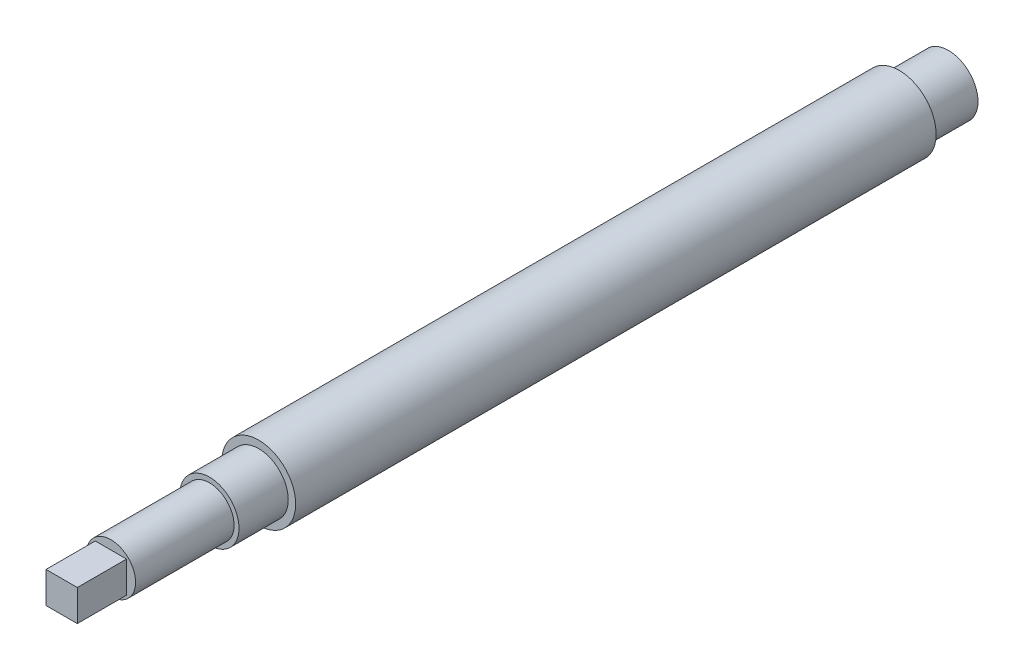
ISO-10303-21;
HEADER;
FILE_DESCRIPTION(('STEP AP214'),'2;1');
FILE_NAME('part.step','',(''),(''),'','','');
FILE_SCHEMA(('AUTOMOTIVE_DESIGN { 1 0 10303 214 1 1 1 1 }'));
ENDSEC;
DATA;
#1=APPLICATION_CONTEXT('core data for automotive mechanical design processes');
#2=APPLICATION_PROTOCOL_DEFINITION('international standard','automotive_design',2000,#1);
#3=PRODUCT_CONTEXT('',#1,'mechanical');
#4=PRODUCT('Part','Part','',(#3));
#5=PRODUCT_RELATED_PRODUCT_CATEGORY('part','',(#4));
#6=PRODUCT_DEFINITION_FORMATION('','',#4);
#7=PRODUCT_DEFINITION_CONTEXT('part definition',#1,'design');
#8=PRODUCT_DEFINITION('design','',#6,#7);
#9=PRODUCT_DEFINITION_SHAPE('','',#8);
#10=(LENGTH_UNIT() NAMED_UNIT(*) SI_UNIT(.MILLI.,.METRE.));
#11=(NAMED_UNIT(*) PLANE_ANGLE_UNIT() SI_UNIT($,.RADIAN.));
#12=(NAMED_UNIT(*) SI_UNIT($,.STERADIAN.) SOLID_ANGLE_UNIT());
#13=UNCERTAINTY_MEASURE_WITH_UNIT(LENGTH_MEASURE(1.E-05),#10,'distance_accuracy_value','');
#14=(GEOMETRIC_REPRESENTATION_CONTEXT(3) GLOBAL_UNCERTAINTY_ASSIGNED_CONTEXT((#13)) GLOBAL_UNIT_ASSIGNED_CONTEXT((#10,
#11,#12)) REPRESENTATION_CONTEXT('',''));
#15=CARTESIAN_POINT('',(0.,0.,0.));
#16=DIRECTION('',(0.,0.,1.));
#17=DIRECTION('',(1.,0.,0.));
#18=AXIS2_PLACEMENT_3D('',#15,#16,#17);
#19=CARTESIAN_POINT('',(0.,0.,160.));
#20=DIRECTION('',(0.,0.,1.));
#21=DIRECTION('',(1.,0.,0.));
#22=AXIS2_PLACEMENT_3D('',#19,#20,#21);
#23=PLANE('',#22);
#24=CARTESIAN_POINT('',(0.,0.,160.));
#25=DIRECTION('',(0.,0.,1.));
#26=DIRECTION('',(1.,0.,0.));
#27=AXIS2_PLACEMENT_3D('',#24,#25,#26);
#28=CIRCLE('',#27,5.);
#29=CARTESIAN_POINT('',(5.,0.,160.));
#30=VERTEX_POINT('',#29);
#31=EDGE_CURVE('E108',#30,#30,#28,.T.);
#32=ORIENTED_EDGE('',*,*,#31,.T.);
#33=EDGE_LOOP('',(#32));
#34=FACE_BOUND('',#33,.T.);
#35=DIRECTION('',(1.,0.,0.));
#36=VECTOR('',#35,1.);
#37=CARTESIAN_POINT('',(-3.175,-3.175,160.));
#38=LINE('',#37,#36);
#39=CARTESIAN_POINT('',(-3.175,-3.175,160.));
#40=VERTEX_POINT('',#39);
#41=CARTESIAN_POINT('',(3.17500000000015,-3.175,160.));
#42=VERTEX_POINT('',#41);
#43=EDGE_CURVE('E86',#40,#42,#38,.T.);
#44=ORIENTED_EDGE('',*,*,#43,.F.);
#45=DIRECTION('',(0.,-1.,0.));
#46=VECTOR('',#45,1.);
#47=CARTESIAN_POINT('',(-3.175,3.175,160.));
#48=LINE('',#47,#46);
#49=CARTESIAN_POINT('',(-3.175,3.175,160.));
#50=VERTEX_POINT('',#49);
#51=EDGE_CURVE('E97',#50,#40,#48,.T.);
#52=ORIENTED_EDGE('',*,*,#51,.F.);
#53=DIRECTION('',(-1.,0.,0.));
#54=VECTOR('',#53,1.);
#55=CARTESIAN_POINT('',(-3.175,3.175,160.));
#56=LINE('',#55,#54);
#57=CARTESIAN_POINT('',(3.17500000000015,3.175,160.));
#58=VERTEX_POINT('',#57);
#59=EDGE_CURVE('E67',#58,#50,#56,.T.);
#60=ORIENTED_EDGE('',*,*,#59,.F.);
#61=DIRECTION('',(0.,1.,0.));
#62=VECTOR('',#61,1.);
#63=CARTESIAN_POINT('',(3.17500000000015,3.175,160.));
#64=LINE('',#63,#62);
#65=EDGE_CURVE('E101',#42,#58,#64,.T.);
#66=ORIENTED_EDGE('',*,*,#65,.F.);
#67=EDGE_LOOP('',(#44,#52,#60,#66));
#68=FACE_BOUND('',#67,.T.);
#69=ADVANCED_FACE('F30',(#34,#68),#23,.T.);
#70=CARTESIAN_POINT('',(0.,0.,140.));
#71=DIRECTION('',(0.,0.,1.));
#72=DIRECTION('',(1.,0.,0.));
#73=AXIS2_PLACEMENT_3D('',#70,#71,#72);
#74=PLANE('',#73);
#75=CARTESIAN_POINT('',(0.,0.,140.));
#76=DIRECTION('',(0.,0.,1.));
#77=DIRECTION('',(1.,0.,0.));
#78=AXIS2_PLACEMENT_3D('',#75,#76,#77);
#79=CIRCLE('',#78,6.);
#80=CARTESIAN_POINT('',(6.,0.,140.));
#81=VERTEX_POINT('',#80);
#82=EDGE_CURVE('E117',#81,#81,#79,.T.);
#83=ORIENTED_EDGE('',*,*,#82,.T.);
#84=EDGE_LOOP('',(#83));
#85=FACE_BOUND('',#84,.T.);
#86=CARTESIAN_POINT('',(0.,0.,140.));
#87=DIRECTION('',(0.,0.,1.));
#88=DIRECTION('',(1.,0.,0.));
#89=AXIS2_PLACEMENT_3D('',#86,#87,#88);
#90=CIRCLE('',#89,5.);
#91=CARTESIAN_POINT('',(5.,0.,140.));
#92=VERTEX_POINT('',#91);
#93=EDGE_CURVE('E107',#92,#92,#90,.T.);
#94=ORIENTED_EDGE('',*,*,#93,.F.);
#95=EDGE_LOOP('',(#94));
#96=FACE_BOUND('',#95,.T.);
#97=ADVANCED_FACE('F132',(#85,#96),#74,.T.);
#98=CARTESIAN_POINT('',(0.,0.,0.));
#99=DIRECTION('',(0.,0.,1.));
#100=DIRECTION('',(1.,0.,0.));
#101=AXIS2_PLACEMENT_3D('',#98,#99,#100);
#102=PLANE('',#101);
#103=CARTESIAN_POINT('',(0.,0.,0.));
#104=DIRECTION('',(0.,0.,1.));
#105=DIRECTION('',(1.,0.,0.));
#106=AXIS2_PLACEMENT_3D('',#103,#104,#105);
#107=CIRCLE('',#106,7.5);
#108=CARTESIAN_POINT('',(7.5,0.,0.));
#109=VERTEX_POINT('',#108);
#110=EDGE_CURVE('E120',#109,#109,#107,.T.);
#111=ORIENTED_EDGE('',*,*,#110,.F.);
#112=EDGE_LOOP('',(#111));
#113=FACE_BOUND('',#112,.T.);
#114=CARTESIAN_POINT('',(0.,0.,0.));
#115=DIRECTION('',(0.,0.,1.));
#116=DIRECTION('',(1.,0.,0.));
#117=AXIS2_PLACEMENT_3D('',#114,#115,#116);
#118=CIRCLE('',#117,6.);
#119=CARTESIAN_POINT('',(6.,0.,0.));
#120=VERTEX_POINT('',#119);
#121=EDGE_CURVE('E11',#120,#120,#118,.F.);
#122=ORIENTED_EDGE('',*,*,#121,.F.);
#123=EDGE_LOOP('',(#122));
#124=FACE_BOUND('',#123,.T.);
#125=ADVANCED_FACE('F128',(#113,#124),#102,.F.);
#126=CARTESIAN_POINT('',(0.,0.,130.));
#127=DIRECTION('',(0.,0.,1.));
#128=DIRECTION('',(1.,0.,0.));
#129=AXIS2_PLACEMENT_3D('',#126,#127,#128);
#130=PLANE('',#129);
#131=CARTESIAN_POINT('',(0.,0.,130.));
#132=DIRECTION('',(0.,0.,1.));
#133=DIRECTION('',(1.,0.,0.));
#134=AXIS2_PLACEMENT_3D('',#131,#132,#133);
#135=CIRCLE('',#134,7.5);
#136=CARTESIAN_POINT('',(7.5,0.,130.));
#137=VERTEX_POINT('',#136);
#138=EDGE_CURVE('E38',#137,#137,#135,.T.);
#139=ORIENTED_EDGE('',*,*,#138,.T.);
#140=EDGE_LOOP('',(#139));
#141=FACE_BOUND('',#140,.T.);
#142=CARTESIAN_POINT('',(0.,0.,130.));
#143=DIRECTION('',(0.,0.,1.));
#144=DIRECTION('',(1.,0.,0.));
#145=AXIS2_PLACEMENT_3D('',#142,#143,#144);
#146=CIRCLE('',#145,6.);
#147=CARTESIAN_POINT('',(6.,0.,130.));
#148=VERTEX_POINT('',#147);
#149=EDGE_CURVE('E116',#148,#148,#146,.T.);
#150=ORIENTED_EDGE('',*,*,#149,.F.);
#151=EDGE_LOOP('',(#150));
#152=FACE_BOUND('',#151,.T.);
#153=ADVANCED_FACE('F131',(#141,#152),#130,.T.);
#154=CARTESIAN_POINT('',(0.,0.,130.));
#155=DIRECTION('',(0.,0.,-1.));
#156=DIRECTION('',(-1.,0.,0.));
#157=AXIS2_PLACEMENT_3D('',#154,#155,#156);
#158=CYLINDRICAL_SURFACE('',#157,7.5);
#159=ORIENTED_EDGE('',*,*,#138,.F.);
#160=EDGE_LOOP('',(#159));
#161=FACE_BOUND('',#160,.T.);
#162=ORIENTED_EDGE('',*,*,#110,.T.);
#163=EDGE_LOOP('',(#162));
#164=FACE_BOUND('',#163,.T.);
#165=ADVANCED_FACE('F32',(#161,#164),#158,.T.);
#166=CARTESIAN_POINT('',(0.,0.,140.));
#167=DIRECTION('',(0.,0.,-1.));
#168=DIRECTION('',(-1.,0.,0.));
#169=AXIS2_PLACEMENT_3D('',#166,#167,#168);
#170=CYLINDRICAL_SURFACE('',#169,6.);
#171=ORIENTED_EDGE('',*,*,#82,.F.);
#172=EDGE_LOOP('',(#171));
#173=FACE_BOUND('',#172,.T.);
#174=ORIENTED_EDGE('',*,*,#149,.T.);
#175=EDGE_LOOP('',(#174));
#176=FACE_BOUND('',#175,.T.);
#177=ADVANCED_FACE('F138',(#173,#176),#170,.T.);
#178=CARTESIAN_POINT('',(0.,0.,-10.));
#179=DIRECTION('',(0.,0.,1.));
#180=DIRECTION('',(1.,0.,0.));
#181=AXIS2_PLACEMENT_3D('',#178,#179,#180);
#182=CYLINDRICAL_SURFACE('',#181,6.);
#183=CARTESIAN_POINT('',(0.,0.,-10.));
#184=DIRECTION('',(0.,0.,-1.));
#185=DIRECTION('',(-1.,0.,0.));
#186=AXIS2_PLACEMENT_3D('',#183,#184,#185);
#187=CIRCLE('',#186,6.);
#188=CARTESIAN_POINT('',(-6.,0.,-10.));
#189=VERTEX_POINT('',#188);
#190=EDGE_CURVE('E111',#189,#189,#187,.T.);
#191=ORIENTED_EDGE('',*,*,#190,.F.);
#192=EDGE_LOOP('',(#191));
#193=FACE_BOUND('',#192,.T.);
#194=ORIENTED_EDGE('',*,*,#121,.T.);
#195=EDGE_LOOP('',(#194));
#196=FACE_BOUND('',#195,.T.);
#197=ADVANCED_FACE('F135',(#193,#196),#182,.T.);
#198=CARTESIAN_POINT('',(0.,0.,-10.));
#199=DIRECTION('',(0.,0.,-1.));
#200=DIRECTION('',(-1.,0.,0.));
#201=AXIS2_PLACEMENT_3D('',#198,#199,#200);
#202=PLANE('',#201);
#203=ORIENTED_EDGE('',*,*,#190,.T.);
#204=EDGE_LOOP('',(#203));
#205=FACE_BOUND('',#204,.T.);
#206=ADVANCED_FACE('F137',(#205),#202,.T.);
#207=CARTESIAN_POINT('',(0.,0.,160.));
#208=DIRECTION('',(0.,0.,-1.));
#209=DIRECTION('',(-1.,0.,0.));
#210=AXIS2_PLACEMENT_3D('',#207,#208,#209);
#211=CYLINDRICAL_SURFACE('',#210,5.);
#212=ORIENTED_EDGE('',*,*,#31,.F.);
#213=EDGE_LOOP('',(#212));
#214=FACE_BOUND('',#213,.T.);
#215=ORIENTED_EDGE('',*,*,#93,.T.);
#216=EDGE_LOOP('',(#215));
#217=FACE_BOUND('',#216,.T.);
#218=ADVANCED_FACE('F145',(#214,#217),#211,.T.);
#219=CARTESIAN_POINT('',(-3.175,3.175,170.));
#220=DIRECTION('',(1.,0.,0.));
#221=DIRECTION('',(0.,1.,0.));
#222=AXIS2_PLACEMENT_3D('',#219,#220,#221);
#223=PLANE('',#222);
#224=ORIENTED_EDGE('',*,*,#51,.T.);
#225=DIRECTION('',(0.,0.,-1.));
#226=VECTOR('',#225,1.);
#227=CARTESIAN_POINT('',(-3.175,-3.175,170.));
#228=LINE('',#227,#226);
#229=CARTESIAN_POINT('',(-3.175,-3.175,170.));
#230=VERTEX_POINT('',#229);
#231=EDGE_CURVE('E89',#230,#40,#228,.T.);
#232=ORIENTED_EDGE('',*,*,#231,.F.);
#233=DIRECTION('',(0.,-1.,0.));
#234=VECTOR('',#233,1.);
#235=CARTESIAN_POINT('',(-3.175,3.175,170.));
#236=LINE('',#235,#234);
#237=CARTESIAN_POINT('',(-3.175,3.175,170.));
#238=VERTEX_POINT('',#237);
#239=EDGE_CURVE('E79',#238,#230,#236,.T.);
#240=ORIENTED_EDGE('',*,*,#239,.F.);
#241=DIRECTION('',(0.,0.,-1.));
#242=VECTOR('',#241,1.);
#243=CARTESIAN_POINT('',(-3.175,3.175,170.));
#244=LINE('',#243,#242);
#245=EDGE_CURVE('E93',#238,#50,#244,.T.);
#246=ORIENTED_EDGE('',*,*,#245,.T.);
#247=EDGE_LOOP('',(#224,#232,#240,#246));
#248=FACE_BOUND('',#247,.T.);
#249=ADVANCED_FACE('F162',(#248),#223,.F.);
#250=CARTESIAN_POINT('',(-3.175,-3.175,170.));
#251=DIRECTION('',(0.,1.,0.));
#252=DIRECTION('',(0.,0.,1.));
#253=AXIS2_PLACEMENT_3D('',#250,#251,#252);
#254=PLANE('',#253);
#255=ORIENTED_EDGE('',*,*,#43,.T.);
#256=DIRECTION('',(0.,0.,-1.));
#257=VECTOR('',#256,1.);
#258=CARTESIAN_POINT('',(3.17500000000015,-3.175,170.));
#259=LINE('',#258,#257);
#260=CARTESIAN_POINT('',(3.17500000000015,-3.175,170.));
#261=VERTEX_POINT('',#260);
#262=EDGE_CURVE('E83',#261,#42,#259,.T.);
#263=ORIENTED_EDGE('',*,*,#262,.F.);
#264=DIRECTION('',(1.,0.,0.));
#265=VECTOR('',#264,1.);
#266=CARTESIAN_POINT('',(-3.175,-3.175,170.));
#267=LINE('',#266,#265);
#268=EDGE_CURVE('E74',#230,#261,#267,.T.);
#269=ORIENTED_EDGE('',*,*,#268,.F.);
#270=ORIENTED_EDGE('',*,*,#231,.T.);
#271=EDGE_LOOP('',(#255,#263,#269,#270));
#272=FACE_BOUND('',#271,.T.);
#273=ADVANCED_FACE('F84',(#272),#254,.F.);
#274=CARTESIAN_POINT('',(3.17500000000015,3.175,170.));
#275=DIRECTION('',(-1.,0.,0.));
#276=DIRECTION('',(0.,0.,1.));
#277=AXIS2_PLACEMENT_3D('',#274,#275,#276);
#278=PLANE('',#277);
#279=ORIENTED_EDGE('',*,*,#65,.T.);
#280=DIRECTION('',(0.,0.,-1.));
#281=VECTOR('',#280,1.);
#282=CARTESIAN_POINT('',(3.17500000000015,3.175,170.));
#283=LINE('',#282,#281);
#284=CARTESIAN_POINT('',(3.17500000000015,3.175,170.));
#285=VERTEX_POINT('',#284);
#286=EDGE_CURVE('E45',#285,#58,#283,.T.);
#287=ORIENTED_EDGE('',*,*,#286,.F.);
#288=DIRECTION('',(0.,1.,0.));
#289=VECTOR('',#288,1.);
#290=CARTESIAN_POINT('',(3.17500000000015,3.175,170.));
#291=LINE('',#290,#289);
#292=EDGE_CURVE('E77',#261,#285,#291,.T.);
#293=ORIENTED_EDGE('',*,*,#292,.F.);
#294=ORIENTED_EDGE('',*,*,#262,.T.);
#295=EDGE_LOOP('',(#279,#287,#293,#294));
#296=FACE_BOUND('',#295,.T.);
#297=ADVANCED_FACE('F91',(#296),#278,.F.);
#298=CARTESIAN_POINT('',(-3.175,3.175,170.));
#299=DIRECTION('',(0.,-1.,0.));
#300=DIRECTION('',(0.,0.,-1.));
#301=AXIS2_PLACEMENT_3D('',#298,#299,#300);
#302=PLANE('',#301);
#303=ORIENTED_EDGE('',*,*,#59,.T.);
#304=ORIENTED_EDGE('',*,*,#245,.F.);
#305=DIRECTION('',(-1.,0.,0.));
#306=VECTOR('',#305,1.);
#307=CARTESIAN_POINT('',(-3.175,3.175,170.));
#308=LINE('',#307,#306);
#309=EDGE_CURVE('E53',#285,#238,#308,.T.);
#310=ORIENTED_EDGE('',*,*,#309,.F.);
#311=ORIENTED_EDGE('',*,*,#286,.T.);
#312=EDGE_LOOP('',(#303,#304,#310,#311));
#313=FACE_BOUND('',#312,.T.);
#314=ADVANCED_FACE('F178',(#313),#302,.F.);
#315=CARTESIAN_POINT('',(-3.175,-3.175,170.));
#316=DIRECTION('',(0.,0.,1.));
#317=DIRECTION('',(1.,0.,0.));
#318=AXIS2_PLACEMENT_3D('',#315,#316,#317);
#319=PLANE('',#318);
#320=ORIENTED_EDGE('',*,*,#239,.T.);
#321=ORIENTED_EDGE('',*,*,#268,.T.);
#322=ORIENTED_EDGE('',*,*,#292,.T.);
#323=ORIENTED_EDGE('',*,*,#309,.T.);
#324=EDGE_LOOP('',(#320,#321,#322,#323));
#325=FACE_BOUND('',#324,.T.);
#326=ADVANCED_FACE('F75',(#325),#319,.T.);
#327=CLOSED_SHELL('',(#69,#97,#125,#153,#165,#177,#197,#206,#218,#249,#273,#297,#314,#326));
#328=MANIFOLD_SOLID_BREP('B2',#327);
#329=ADVANCED_BREP_SHAPE_REPRESENTATION('',(#18,#328),#14);
#330=SHAPE_DEFINITION_REPRESENTATION(#9,#329);
ENDSEC;
END-ISO-10303-21;
